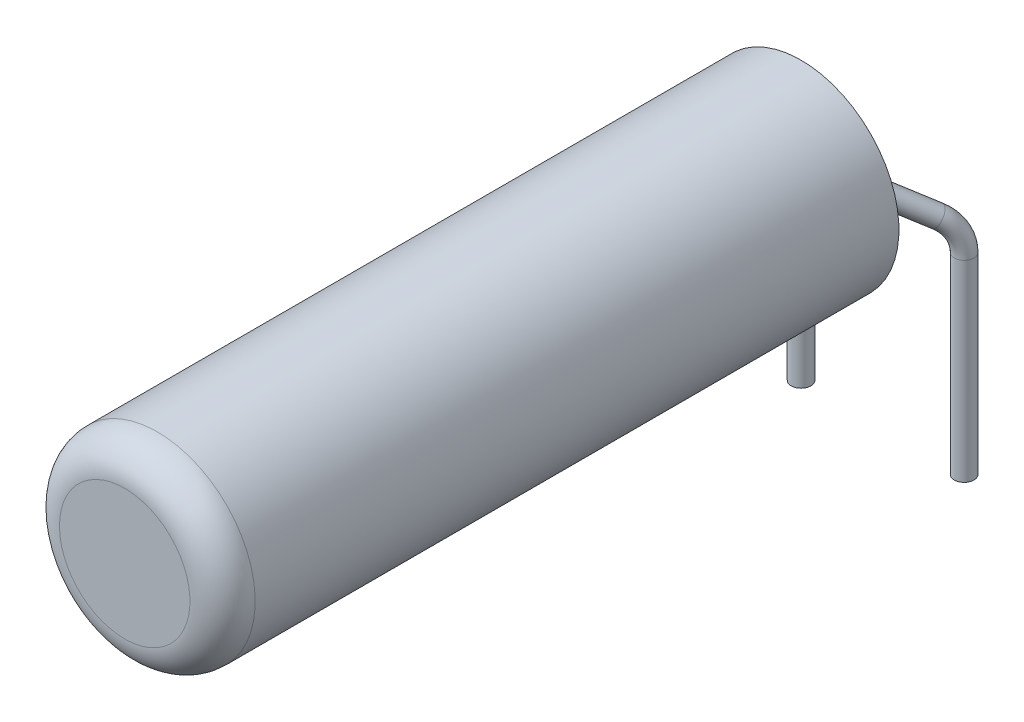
from build123d import *

# Parameters (mm, degrees)
SKETCH_2_R = 0.15
FILLET_1_R = 0.5


with BuildPart() as part:
    # Sketch 1 → Revolve 1 (revolve)
    with BuildSketch(Plane(origin=(0, 0, 0), x_dir=(0, 0, -1), z_dir=(1, 0, 0)), mode=Mode.PRIVATE) as revolve_1_sk:
        Polygon((-11.617328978, 1.5), (-1.45, 1.5), (-1.45, 0.2), (-1.25, 0.2), (-1.25, 0), (-11.617328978, 0), align=None)
    revolve(revolve_1_sk.sketch.rotate(Axis((0, 1.5, 1.45), (0, 0, 1)), 270), axis=Axis((0, 1.5, 1.45), (0, 0, 1)))

    # Sweep 1: sweep along a curve in space
    with BuildLine() as sweep_1_path:
        Line((0.55, 1.5, 1.45), (0.55, 1.5, 1.207586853))
        ThreePointArc((0.55, 1.5, 1.207586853), (0.584062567, 1.465249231, 0.970890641), (0.680725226, 1.366633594, 0.772587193))
        Line((0.680725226, 1.366633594, 0.772587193), (1.078358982, 0.960966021, 0.232941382))
        ThreePointArc((1.078358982, 0.960966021, 0.232941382), (1.204134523, 0.742273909, 0.062246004), (1.25, 0.44764799, 0))
        Line((1.25, 0.44764799, 0), (1.25, -2.5, 0))
    # Sketch 2 → Sweep 1 (sweep)
    with BuildSketch(Plane(origin=(0, 0, 1.45), x_dir=(-1, 0, 0), z_dir=(0, 0, -1))):
        with Locations((-0.55, 1.5)):
            Circle(SKETCH_2_R)
    sweep_1 = sweep(path=sweep_1_path.line)

    # Mirror 1: Sweep 1 across plane
    add(sweep_1.mirror(Plane(origin=(0, 0, 0), x_dir=(0, 0, 1), z_dir=(1, 0, 0))))

    # Fillet 1
    fillet_1_edges = [part.edges().sort_by_distance(p)[0] for p in [
        (1.5, 1.5, 11.617328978),
    ]]
    fillet(fillet_1_edges, radius=FILLET_1_R)


solid = part.part
